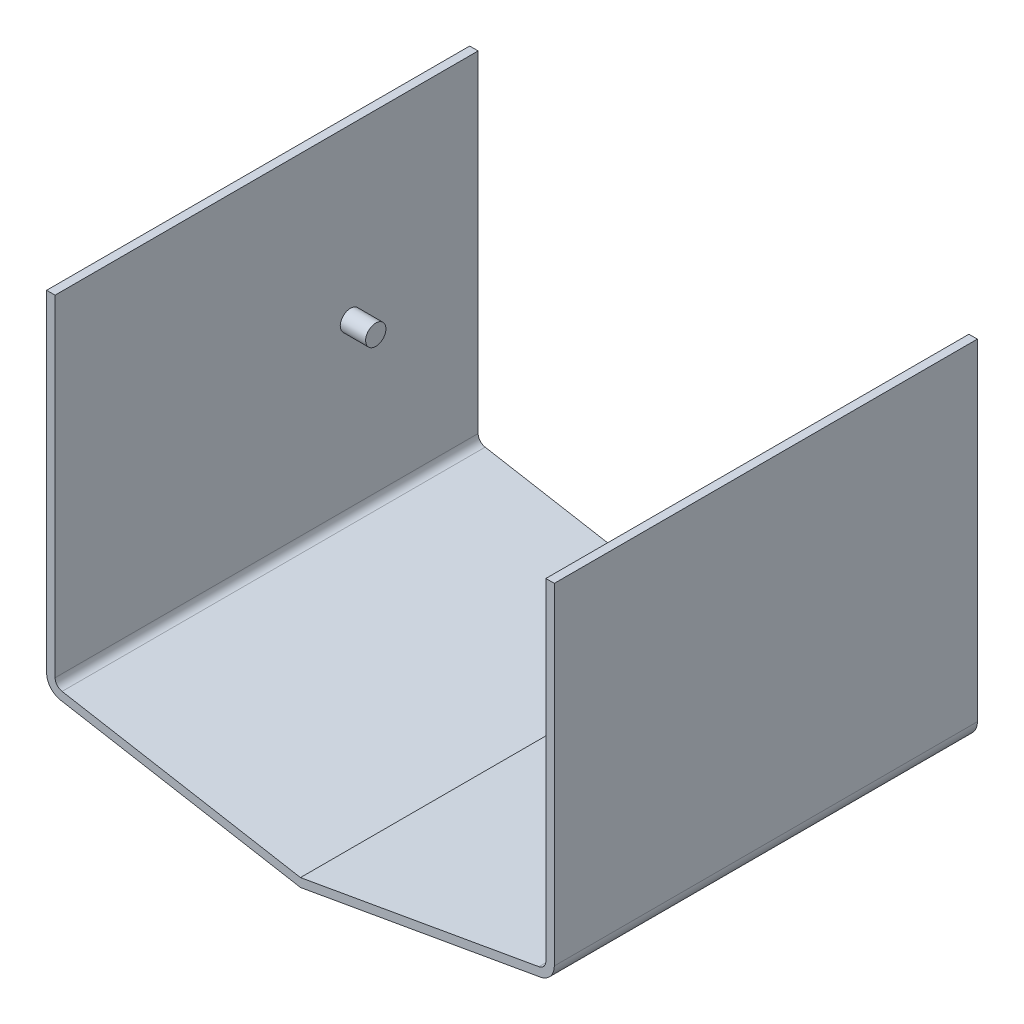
ISO-10303-21;
HEADER;
FILE_DESCRIPTION(('STEP AP214'),'2;1');
FILE_NAME('part.step','',(''),(''),'','','');
FILE_SCHEMA(('AUTOMOTIVE_DESIGN { 1 0 10303 214 1 1 1 1 }'));
ENDSEC;
DATA;
#1=APPLICATION_CONTEXT('core data for automotive mechanical design processes');
#2=APPLICATION_PROTOCOL_DEFINITION('international standard','automotive_design',2000,#1);
#3=PRODUCT_CONTEXT('',#1,'mechanical');
#4=PRODUCT('Part','Part','',(#3));
#5=PRODUCT_RELATED_PRODUCT_CATEGORY('part','',(#4));
#6=PRODUCT_DEFINITION_FORMATION('','',#4);
#7=PRODUCT_DEFINITION_CONTEXT('part definition',#1,'design');
#8=PRODUCT_DEFINITION('design','',#6,#7);
#9=PRODUCT_DEFINITION_SHAPE('','',#8);
#10=(LENGTH_UNIT() NAMED_UNIT(*) SI_UNIT(.MILLI.,.METRE.));
#11=(NAMED_UNIT(*) PLANE_ANGLE_UNIT() SI_UNIT($,.RADIAN.));
#12=(NAMED_UNIT(*) SI_UNIT($,.STERADIAN.) SOLID_ANGLE_UNIT());
#13=UNCERTAINTY_MEASURE_WITH_UNIT(LENGTH_MEASURE(1.E-05),#10,'distance_accuracy_value','');
#14=(GEOMETRIC_REPRESENTATION_CONTEXT(3) GLOBAL_UNCERTAINTY_ASSIGNED_CONTEXT((#13)) GLOBAL_UNIT_ASSIGNED_CONTEXT((#10,
#11,#12)) REPRESENTATION_CONTEXT('',''));
#15=CARTESIAN_POINT('',(0.,0.,0.));
#16=DIRECTION('',(0.,0.,1.));
#17=DIRECTION('',(1.,0.,0.));
#18=AXIS2_PLACEMENT_3D('',#15,#16,#17);
#19=CARTESIAN_POINT('',(-290.,0.,500.));
#20=DIRECTION('',(-1.,0.,0.));
#21=DIRECTION('',(0.,-1.,0.));
#22=AXIS2_PLACEMENT_3D('',#19,#20,#21);
#23=PLANE('',#22);
#24=DIRECTION('',(0.,1.,0.));
#25=VECTOR('',#24,1.);
#26=CARTESIAN_POINT('',(-290.,0.,0.));
#27=LINE('',#26,#25);
#28=CARTESIAN_POINT('',(-290.,-391.609003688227,0.));
#29=VERTEX_POINT('',#28);
#30=CARTESIAN_POINT('',(-290.,0.,0.));
#31=VERTEX_POINT('',#30);
#32=EDGE_CURVE('E178',#29,#31,#27,.T.);
#33=ORIENTED_EDGE('',*,*,#32,.T.);
#34=DIRECTION('',(0.,0.,-1.));
#35=VECTOR('',#34,1.);
#36=CARTESIAN_POINT('',(-290.,0.,500.));
#37=LINE('',#36,#35);
#38=CARTESIAN_POINT('',(-290.,0.,500.));
#39=VERTEX_POINT('',#38);
#40=EDGE_CURVE('E149',#39,#31,#37,.T.);
#41=ORIENTED_EDGE('',*,*,#40,.F.);
#42=DIRECTION('',(0.,1.,0.));
#43=VECTOR('',#42,1.);
#44=CARTESIAN_POINT('',(-290.,0.,500.));
#45=LINE('',#44,#43);
#46=CARTESIAN_POINT('',(-290.,-391.609003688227,500.));
#47=VERTEX_POINT('',#46);
#48=EDGE_CURVE('E44',#47,#39,#45,.T.);
#49=ORIENTED_EDGE('',*,*,#48,.F.);
#50=DIRECTION('',(0.,0.,-1.));
#51=VECTOR('',#50,1.);
#52=CARTESIAN_POINT('',(-290.,-391.609003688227,500.));
#53=LINE('',#52,#51);
#54=EDGE_CURVE('E206',#47,#29,#53,.T.);
#55=ORIENTED_EDGE('',*,*,#54,.T.);
#56=EDGE_LOOP('',(#33,#41,#49,#55));
#57=FACE_BOUND('',#56,.T.);
#58=CARTESIAN_POINT('',(-290.,-200.,151.));
#59=DIRECTION('',(-1.,0.,0.));
#60=DIRECTION('',(0.,-1.,0.));
#61=AXIS2_PLACEMENT_3D('',#58,#59,#60);
#62=CIRCLE('',#61,12.);
#63=CARTESIAN_POINT('',(-290.,-212.,151.));
#64=VERTEX_POINT('',#63);
#65=EDGE_CURVE('E11',#64,#64,#62,.F.);
#66=ORIENTED_EDGE('',*,*,#65,.F.);
#67=EDGE_LOOP('',(#66));
#68=FACE_BOUND('',#67,.T.);
#69=ADVANCED_FACE('F29',(#57,#68),#23,.F.);
#70=CARTESIAN_POINT('',(-290.,0.,500.));
#71=DIRECTION('',(0.,-1.,0.));
#72=DIRECTION('',(0.,0.,-1.));
#73=AXIS2_PLACEMENT_3D('',#70,#71,#72);
#74=PLANE('',#73);
#75=DIRECTION('',(-1.,0.,0.));
#76=VECTOR('',#75,1.);
#77=CARTESIAN_POINT('',(-290.,0.,0.));
#78=LINE('',#77,#76);
#79=CARTESIAN_POINT('',(-300.,0.,0.));
#80=VERTEX_POINT('',#79);
#81=EDGE_CURVE('E135',#31,#80,#78,.T.);
#82=ORIENTED_EDGE('',*,*,#81,.T.);
#83=DIRECTION('',(0.,0.,-1.));
#84=VECTOR('',#83,1.);
#85=CARTESIAN_POINT('',(-300.,0.,500.));
#86=LINE('',#85,#84);
#87=CARTESIAN_POINT('',(-300.,0.,500.));
#88=VERTEX_POINT('',#87);
#89=EDGE_CURVE('E37',#88,#80,#86,.T.);
#90=ORIENTED_EDGE('',*,*,#89,.F.);
#91=DIRECTION('',(-1.,0.,0.));
#92=VECTOR('',#91,1.);
#93=CARTESIAN_POINT('',(-290.,0.,500.));
#94=LINE('',#93,#92);
#95=EDGE_CURVE('E180',#39,#88,#94,.T.);
#96=ORIENTED_EDGE('',*,*,#95,.F.);
#97=ORIENTED_EDGE('',*,*,#40,.T.);
#98=EDGE_LOOP('',(#82,#90,#96,#97));
#99=FACE_BOUND('',#98,.T.);
#100=ADVANCED_FACE('F31',(#99),#74,.F.);
#101=CARTESIAN_POINT('',(-300.,0.,500.));
#102=DIRECTION('',(1.,0.,0.));
#103=DIRECTION('',(0.,1.,0.));
#104=AXIS2_PLACEMENT_3D('',#101,#102,#103);
#105=PLANE('',#104);
#106=DIRECTION('',(0.,-1.,0.));
#107=VECTOR('',#106,1.);
#108=CARTESIAN_POINT('',(-300.,0.,0.));
#109=LINE('',#108,#107);
#110=CARTESIAN_POINT('',(-300.,-391.609003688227,0.));
#111=VERTEX_POINT('',#110);
#112=EDGE_CURVE('E130',#80,#111,#109,.T.);
#113=ORIENTED_EDGE('',*,*,#112,.T.);
#114=DIRECTION('',(0.,0.,-1.));
#115=VECTOR('',#114,1.);
#116=CARTESIAN_POINT('',(-300.,-391.609003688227,500.));
#117=LINE('',#116,#115);
#118=CARTESIAN_POINT('',(-300.,-391.609003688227,500.));
#119=VERTEX_POINT('',#118);
#120=EDGE_CURVE('E147',#119,#111,#117,.T.);
#121=ORIENTED_EDGE('',*,*,#120,.F.);
#122=DIRECTION('',(0.,-1.,0.));
#123=VECTOR('',#122,1.);
#124=CARTESIAN_POINT('',(-300.,0.,500.));
#125=LINE('',#124,#123);
#126=EDGE_CURVE('E144',#88,#119,#125,.T.);
#127=ORIENTED_EDGE('',*,*,#126,.F.);
#128=ORIENTED_EDGE('',*,*,#89,.T.);
#129=EDGE_LOOP('',(#113,#121,#127,#128));
#130=FACE_BOUND('',#129,.T.);
#131=ADVANCED_FACE('F143',(#130),#105,.F.);
#132=CARTESIAN_POINT('',(-280.,-391.609003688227,500.));
#133=DIRECTION('',(0.,0.,-1.));
#134=DIRECTION('',(-1.,0.,0.));
#135=AXIS2_PLACEMENT_3D('',#132,#133,#134);
#136=CYLINDRICAL_SURFACE('',#135,20.);
#137=CARTESIAN_POINT('',(-280.,-391.609003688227,0.));
#138=DIRECTION('',(0.,0.,1.));
#139=DIRECTION('',(1.,0.,0.));
#140=AXIS2_PLACEMENT_3D('',#137,#138,#139);
#141=CIRCLE('',#140,20.);
#142=CARTESIAN_POINT('',(-283.472963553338,-411.305158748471,0.));
#143=VERTEX_POINT('',#142);
#144=EDGE_CURVE('E137',#111,#143,#141,.T.);
#145=ORIENTED_EDGE('',*,*,#144,.T.);
#146=DIRECTION('',(0.,0.,-1.));
#147=VECTOR('',#146,1.);
#148=CARTESIAN_POINT('',(-283.472963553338,-411.305158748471,500.));
#149=LINE('',#148,#147);
#150=CARTESIAN_POINT('',(-283.472963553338,-411.305158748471,500.));
#151=VERTEX_POINT('',#150);
#152=EDGE_CURVE('E236',#151,#143,#149,.T.);
#153=ORIENTED_EDGE('',*,*,#152,.F.);
#154=CARTESIAN_POINT('',(-280.,-391.609003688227,500.));
#155=DIRECTION('',(0.,0.,1.));
#156=DIRECTION('',(1.,0.,0.));
#157=AXIS2_PLACEMENT_3D('',#154,#155,#156);
#158=CIRCLE('',#157,20.);
#159=EDGE_CURVE('E183',#119,#151,#158,.T.);
#160=ORIENTED_EDGE('',*,*,#159,.F.);
#161=ORIENTED_EDGE('',*,*,#120,.T.);
#162=EDGE_LOOP('',(#145,#153,#160,#161));
#163=FACE_BOUND('',#162,.T.);
#164=ADVANCED_FACE('F241',(#163),#136,.T.);
#165=CARTESIAN_POINT('',(0.,-461.289090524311,500.));
#166=DIRECTION('',(0.173648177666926,0.984807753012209,0.));
#167=DIRECTION('',(-0.984807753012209,0.173648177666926,0.));
#168=AXIS2_PLACEMENT_3D('',#165,#166,#167);
#169=PLANE('',#168);
#170=DIRECTION('',(0.984807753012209,-0.173648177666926,0.));
#171=VECTOR('',#170,1.);
#172=CARTESIAN_POINT('',(0.,-461.289090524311,0.));
#173=LINE('',#172,#171);
#174=CARTESIAN_POINT('',(0.,-461.289090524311,0.));
#175=VERTEX_POINT('',#174);
#176=EDGE_CURVE('E158',#143,#175,#173,.T.);
#177=ORIENTED_EDGE('',*,*,#176,.T.);
#178=DIRECTION('',(0.,0.,-1.));
#179=VECTOR('',#178,1.);
#180=CARTESIAN_POINT('',(0.,-461.289090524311,500.));
#181=LINE('',#180,#179);
#182=CARTESIAN_POINT('',(0.,-461.289090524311,500.));
#183=VERTEX_POINT('',#182);
#184=EDGE_CURVE('E233',#183,#175,#181,.T.);
#185=ORIENTED_EDGE('',*,*,#184,.F.);
#186=DIRECTION('',(0.984807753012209,-0.173648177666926,0.));
#187=VECTOR('',#186,1.);
#188=CARTESIAN_POINT('',(0.,-461.289090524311,500.));
#189=LINE('',#188,#187);
#190=EDGE_CURVE('E185',#151,#183,#189,.T.);
#191=ORIENTED_EDGE('',*,*,#190,.F.);
#192=ORIENTED_EDGE('',*,*,#152,.T.);
#193=EDGE_LOOP('',(#177,#185,#191,#192));
#194=FACE_BOUND('',#193,.T.);
#195=ADVANCED_FACE('F249',(#194),#169,.F.);
#196=CARTESIAN_POINT('',(283.472963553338,-411.305158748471,500.));
#197=DIRECTION('',(-0.173648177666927,0.984807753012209,0.));
#198=DIRECTION('',(-0.984807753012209,-0.173648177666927,0.));
#199=AXIS2_PLACEMENT_3D('',#196,#197,#198);
#200=PLANE('',#199);
#201=DIRECTION('',(0.984807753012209,0.173648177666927,0.));
#202=VECTOR('',#201,1.);
#203=CARTESIAN_POINT('',(283.472963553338,-411.305158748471,0.));
#204=LINE('',#203,#202);
#205=CARTESIAN_POINT('',(283.472963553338,-411.305158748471,0.));
#206=VERTEX_POINT('',#205);
#207=EDGE_CURVE('E160',#175,#206,#204,.T.);
#208=ORIENTED_EDGE('',*,*,#207,.T.);
#209=DIRECTION('',(0.,0.,-1.));
#210=VECTOR('',#209,1.);
#211=CARTESIAN_POINT('',(283.472963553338,-411.305158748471,500.));
#212=LINE('',#211,#210);
#213=CARTESIAN_POINT('',(283.472963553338,-411.305158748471,500.));
#214=VERTEX_POINT('',#213);
#215=EDGE_CURVE('E230',#214,#206,#212,.T.);
#216=ORIENTED_EDGE('',*,*,#215,.F.);
#217=DIRECTION('',(0.984807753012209,0.173648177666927,0.));
#218=VECTOR('',#217,1.);
#219=CARTESIAN_POINT('',(283.472963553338,-411.305158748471,500.));
#220=LINE('',#219,#218);
#221=EDGE_CURVE('E187',#183,#214,#220,.T.);
#222=ORIENTED_EDGE('',*,*,#221,.F.);
#223=ORIENTED_EDGE('',*,*,#184,.T.);
#224=EDGE_LOOP('',(#208,#216,#222,#223));
#225=FACE_BOUND('',#224,.T.);
#226=ADVANCED_FACE('F252',(#225),#200,.F.);
#227=CARTESIAN_POINT('',(280.,-391.609003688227,500.));
#228=DIRECTION('',(0.,0.,-1.));
#229=DIRECTION('',(-1.,0.,0.));
#230=AXIS2_PLACEMENT_3D('',#227,#228,#229);
#231=CYLINDRICAL_SURFACE('',#230,20.);
#232=CARTESIAN_POINT('',(280.,-391.609003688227,0.));
#233=DIRECTION('',(0.,0.,1.));
#234=DIRECTION('',(-1.,0.,0.));
#235=AXIS2_PLACEMENT_3D('',#232,#233,#234);
#236=CIRCLE('',#235,20.);
#237=CARTESIAN_POINT('',(300.,-391.609003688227,0.));
#238=VERTEX_POINT('',#237);
#239=EDGE_CURVE('E162',#206,#238,#236,.T.);
#240=ORIENTED_EDGE('',*,*,#239,.T.);
#241=DIRECTION('',(0.,0.,-1.));
#242=VECTOR('',#241,1.);
#243=CARTESIAN_POINT('',(300.,-391.609003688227,500.));
#244=LINE('',#243,#242);
#245=CARTESIAN_POINT('',(300.,-391.609003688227,500.));
#246=VERTEX_POINT('',#245);
#247=EDGE_CURVE('E227',#246,#238,#244,.T.);
#248=ORIENTED_EDGE('',*,*,#247,.F.);
#249=CARTESIAN_POINT('',(280.,-391.609003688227,500.));
#250=DIRECTION('',(0.,0.,1.));
#251=DIRECTION('',(-1.,0.,0.));
#252=AXIS2_PLACEMENT_3D('',#249,#250,#251);
#253=CIRCLE('',#252,20.);
#254=EDGE_CURVE('E189',#214,#246,#253,.T.);
#255=ORIENTED_EDGE('',*,*,#254,.F.);
#256=ORIENTED_EDGE('',*,*,#215,.T.);
#257=EDGE_LOOP('',(#240,#248,#255,#256));
#258=FACE_BOUND('',#257,.T.);
#259=ADVANCED_FACE('F257',(#258),#231,.T.);
#260=CARTESIAN_POINT('',(300.,3.33066907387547E-13,500.));
#261=DIRECTION('',(-1.,0.,0.));
#262=DIRECTION('',(0.,-1.,0.));
#263=AXIS2_PLACEMENT_3D('',#260,#261,#262);
#264=PLANE('',#263);
#265=DIRECTION('',(0.,1.,0.));
#266=VECTOR('',#265,1.);
#267=CARTESIAN_POINT('',(300.,3.33066907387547E-13,0.));
#268=LINE('',#267,#266);
#269=CARTESIAN_POINT('',(300.,3.33066907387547E-13,0.));
#270=VERTEX_POINT('',#269);
#271=EDGE_CURVE('E164',#238,#270,#268,.T.);
#272=ORIENTED_EDGE('',*,*,#271,.T.);
#273=DIRECTION('',(0.,0.,-1.));
#274=VECTOR('',#273,1.);
#275=CARTESIAN_POINT('',(300.,3.33066907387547E-13,500.));
#276=LINE('',#275,#274);
#277=CARTESIAN_POINT('',(300.,3.33066907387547E-13,500.));
#278=VERTEX_POINT('',#277);
#279=EDGE_CURVE('E224',#278,#270,#276,.T.);
#280=ORIENTED_EDGE('',*,*,#279,.F.);
#281=DIRECTION('',(0.,1.,0.));
#282=VECTOR('',#281,1.);
#283=CARTESIAN_POINT('',(300.,3.33066907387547E-13,500.));
#284=LINE('',#283,#282);
#285=EDGE_CURVE('E191',#246,#278,#284,.T.);
#286=ORIENTED_EDGE('',*,*,#285,.F.);
#287=ORIENTED_EDGE('',*,*,#247,.T.);
#288=EDGE_LOOP('',(#272,#280,#286,#287));
#289=FACE_BOUND('',#288,.T.);
#290=ADVANCED_FACE('F263',(#289),#264,.F.);
#291=CARTESIAN_POINT('',(290.,3.33066907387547E-13,500.));
#292=DIRECTION('',(0.,-1.,0.));
#293=DIRECTION('',(0.,0.,-1.));
#294=AXIS2_PLACEMENT_3D('',#291,#292,#293);
#295=PLANE('',#294);
#296=DIRECTION('',(-1.,0.,0.));
#297=VECTOR('',#296,1.);
#298=CARTESIAN_POINT('',(290.,3.33066907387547E-13,0.));
#299=LINE('',#298,#297);
#300=CARTESIAN_POINT('',(290.,3.33066907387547E-13,0.));
#301=VERTEX_POINT('',#300);
#302=EDGE_CURVE('E166',#270,#301,#299,.T.);
#303=ORIENTED_EDGE('',*,*,#302,.T.);
#304=DIRECTION('',(0.,0.,-1.));
#305=VECTOR('',#304,1.);
#306=CARTESIAN_POINT('',(290.,3.33066907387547E-13,500.));
#307=LINE('',#306,#305);
#308=CARTESIAN_POINT('',(290.,3.33066907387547E-13,500.));
#309=VERTEX_POINT('',#308);
#310=EDGE_CURVE('E221',#309,#301,#307,.T.);
#311=ORIENTED_EDGE('',*,*,#310,.F.);
#312=DIRECTION('',(-1.,0.,0.));
#313=VECTOR('',#312,1.);
#314=CARTESIAN_POINT('',(290.,3.33066907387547E-13,500.));
#315=LINE('',#314,#313);
#316=EDGE_CURVE('E193',#278,#309,#315,.T.);
#317=ORIENTED_EDGE('',*,*,#316,.F.);
#318=ORIENTED_EDGE('',*,*,#279,.T.);
#319=EDGE_LOOP('',(#303,#311,#317,#318));
#320=FACE_BOUND('',#319,.T.);
#321=ADVANCED_FACE('F267',(#320),#295,.F.);
#322=CARTESIAN_POINT('',(290.,-391.609003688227,500.));
#323=DIRECTION('',(1.,0.,0.));
#324=DIRECTION('',(0.,0.,-1.));
#325=AXIS2_PLACEMENT_3D('',#322,#323,#324);
#326=PLANE('',#325);
#327=CARTESIAN_POINT('',(290.,-200.,151.));
#328=DIRECTION('',(1.,0.,0.));
#329=DIRECTION('',(0.,1.,0.));
#330=AXIS2_PLACEMENT_3D('',#327,#328,#329);
#331=CIRCLE('',#330,12.);
#332=CARTESIAN_POINT('',(290.,-188.,151.));
#333=VERTEX_POINT('',#332);
#334=EDGE_CURVE('E386',#333,#333,#331,.T.);
#335=ORIENTED_EDGE('',*,*,#334,.T.);
#336=EDGE_LOOP('',(#335));
#337=FACE_BOUND('',#336,.T.);
#338=DIRECTION('',(0.,-1.,0.));
#339=VECTOR('',#338,1.);
#340=CARTESIAN_POINT('',(290.,-391.609003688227,0.));
#341=LINE('',#340,#339);
#342=CARTESIAN_POINT('',(290.,-391.609003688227,0.));
#343=VERTEX_POINT('',#342);
#344=EDGE_CURVE('E168',#301,#343,#341,.T.);
#345=ORIENTED_EDGE('',*,*,#344,.T.);
#346=DIRECTION('',(0.,0.,-1.));
#347=VECTOR('',#346,1.);
#348=CARTESIAN_POINT('',(290.,-391.609003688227,500.));
#349=LINE('',#348,#347);
#350=CARTESIAN_POINT('',(290.,-391.609003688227,500.));
#351=VERTEX_POINT('',#350);
#352=EDGE_CURVE('E218',#351,#343,#349,.T.);
#353=ORIENTED_EDGE('',*,*,#352,.F.);
#354=DIRECTION('',(0.,-1.,0.));
#355=VECTOR('',#354,1.);
#356=CARTESIAN_POINT('',(290.,-391.609003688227,500.));
#357=LINE('',#356,#355);
#358=EDGE_CURVE('E195',#309,#351,#357,.T.);
#359=ORIENTED_EDGE('',*,*,#358,.F.);
#360=ORIENTED_EDGE('',*,*,#310,.T.);
#361=EDGE_LOOP('',(#345,#353,#359,#360));
#362=FACE_BOUND('',#361,.T.);
#363=ADVANCED_FACE('F272',(#337,#362),#326,.F.);
#364=CARTESIAN_POINT('',(280.,-391.609003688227,500.));
#365=DIRECTION('',(0.,0.,-1.));
#366=DIRECTION('',(-1.,0.,0.));
#367=AXIS2_PLACEMENT_3D('',#364,#365,#366);
#368=CYLINDRICAL_SURFACE('',#367,9.99999999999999);
#369=CARTESIAN_POINT('',(280.,-391.609003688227,0.));
#370=DIRECTION('',(0.,0.,-1.));
#371=DIRECTION('',(1.,0.,0.));
#372=AXIS2_PLACEMENT_3D('',#369,#370,#371);
#373=CIRCLE('',#372,9.99999999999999);
#374=CARTESIAN_POINT('',(281.736481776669,-401.457081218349,0.));
#375=VERTEX_POINT('',#374);
#376=EDGE_CURVE('E170',#343,#375,#373,.T.);
#377=ORIENTED_EDGE('',*,*,#376,.T.);
#378=DIRECTION('',(0.,0.,-1.));
#379=VECTOR('',#378,1.);
#380=CARTESIAN_POINT('',(281.736481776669,-401.457081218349,500.));
#381=LINE('',#380,#379);
#382=CARTESIAN_POINT('',(281.736481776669,-401.457081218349,500.));
#383=VERTEX_POINT('',#382);
#384=EDGE_CURVE('E215',#383,#375,#381,.T.);
#385=ORIENTED_EDGE('',*,*,#384,.F.);
#386=CARTESIAN_POINT('',(280.,-391.609003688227,500.));
#387=DIRECTION('',(0.,0.,-1.));
#388=DIRECTION('',(1.,0.,0.));
#389=AXIS2_PLACEMENT_3D('',#386,#387,#388);
#390=CIRCLE('',#389,9.99999999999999);
#391=EDGE_CURVE('E197',#351,#383,#390,.T.);
#392=ORIENTED_EDGE('',*,*,#391,.F.);
#393=ORIENTED_EDGE('',*,*,#352,.T.);
#394=EDGE_LOOP('',(#377,#385,#392,#393));
#395=FACE_BOUND('',#394,.T.);
#396=ADVANCED_FACE('F278',(#395),#368,.F.);
#397=CARTESIAN_POINT('',(0.,-451.134824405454,500.));
#398=DIRECTION('',(0.173648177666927,-0.984807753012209,0.));
#399=DIRECTION('',(0.984807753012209,0.173648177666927,0.));
#400=AXIS2_PLACEMENT_3D('',#397,#398,#399);
#401=PLANE('',#400);
#402=DIRECTION('',(-0.984807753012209,-0.173648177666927,0.));
#403=VECTOR('',#402,1.);
#404=CARTESIAN_POINT('',(0.,-451.134824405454,0.));
#405=LINE('',#404,#403);
#406=CARTESIAN_POINT('',(0.,-451.134824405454,0.));
#407=VERTEX_POINT('',#406);
#408=EDGE_CURVE('E172',#375,#407,#405,.T.);
#409=ORIENTED_EDGE('',*,*,#408,.T.);
#410=DIRECTION('',(0.,0.,-1.));
#411=VECTOR('',#410,1.);
#412=CARTESIAN_POINT('',(0.,-451.134824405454,500.));
#413=LINE('',#412,#411);
#414=CARTESIAN_POINT('',(0.,-451.134824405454,500.));
#415=VERTEX_POINT('',#414);
#416=EDGE_CURVE('E212',#415,#407,#413,.T.);
#417=ORIENTED_EDGE('',*,*,#416,.F.);
#418=DIRECTION('',(-0.984807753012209,-0.173648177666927,0.));
#419=VECTOR('',#418,1.);
#420=CARTESIAN_POINT('',(0.,-451.134824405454,500.));
#421=LINE('',#420,#419);
#422=EDGE_CURVE('E199',#383,#415,#421,.T.);
#423=ORIENTED_EDGE('',*,*,#422,.F.);
#424=ORIENTED_EDGE('',*,*,#384,.T.);
#425=EDGE_LOOP('',(#409,#417,#423,#424));
#426=FACE_BOUND('',#425,.T.);
#427=ADVANCED_FACE('F282',(#426),#401,.F.);
#428=CARTESIAN_POINT('',(-281.736481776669,-401.457081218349,500.));
#429=DIRECTION('',(-0.173648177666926,-0.984807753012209,0.));
#430=DIRECTION('',(0.984807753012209,-0.173648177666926,0.));
#431=AXIS2_PLACEMENT_3D('',#428,#429,#430);
#432=PLANE('',#431);
#433=DIRECTION('',(-0.984807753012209,0.173648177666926,0.));
#434=VECTOR('',#433,1.);
#435=CARTESIAN_POINT('',(-281.736481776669,-401.457081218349,0.));
#436=LINE('',#435,#434);
#437=CARTESIAN_POINT('',(-281.736481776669,-401.457081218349,0.));
#438=VERTEX_POINT('',#437);
#439=EDGE_CURVE('E174',#407,#438,#436,.T.);
#440=ORIENTED_EDGE('',*,*,#439,.T.);
#441=DIRECTION('',(0.,0.,-1.));
#442=VECTOR('',#441,1.);
#443=CARTESIAN_POINT('',(-281.736481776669,-401.457081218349,500.));
#444=LINE('',#443,#442);
#445=CARTESIAN_POINT('',(-281.736481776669,-401.457081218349,500.));
#446=VERTEX_POINT('',#445);
#447=EDGE_CURVE('E209',#446,#438,#444,.T.);
#448=ORIENTED_EDGE('',*,*,#447,.F.);
#449=DIRECTION('',(-0.984807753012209,0.173648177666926,0.));
#450=VECTOR('',#449,1.);
#451=CARTESIAN_POINT('',(-281.736481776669,-401.457081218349,500.));
#452=LINE('',#451,#450);
#453=EDGE_CURVE('E201',#415,#446,#452,.T.);
#454=ORIENTED_EDGE('',*,*,#453,.F.);
#455=ORIENTED_EDGE('',*,*,#416,.T.);
#456=EDGE_LOOP('',(#440,#448,#454,#455));
#457=FACE_BOUND('',#456,.T.);
#458=ADVANCED_FACE('F287',(#457),#432,.F.);
#459=CARTESIAN_POINT('',(-280.,-391.609003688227,500.));
#460=DIRECTION('',(0.,0.,-1.));
#461=DIRECTION('',(-1.,0.,0.));
#462=AXIS2_PLACEMENT_3D('',#459,#460,#461);
#463=CYLINDRICAL_SURFACE('',#462,9.99999999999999);
#464=CARTESIAN_POINT('',(-280.,-391.609003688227,0.));
#465=DIRECTION('',(0.,0.,-1.));
#466=DIRECTION('',(1.,0.,0.));
#467=AXIS2_PLACEMENT_3D('',#464,#465,#466);
#468=CIRCLE('',#467,9.99999999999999);
#469=EDGE_CURVE('E176',#438,#29,#468,.T.);
#470=ORIENTED_EDGE('',*,*,#469,.T.);
#471=ORIENTED_EDGE('',*,*,#54,.F.);
#472=CARTESIAN_POINT('',(-280.,-391.609003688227,500.));
#473=DIRECTION('',(0.,0.,-1.));
#474=DIRECTION('',(1.,0.,0.));
#475=AXIS2_PLACEMENT_3D('',#472,#473,#474);
#476=CIRCLE('',#475,9.99999999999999);
#477=EDGE_CURVE('E49',#446,#47,#476,.T.);
#478=ORIENTED_EDGE('',*,*,#477,.F.);
#479=ORIENTED_EDGE('',*,*,#447,.T.);
#480=EDGE_LOOP('',(#470,#471,#478,#479));
#481=FACE_BOUND('',#480,.T.);
#482=ADVANCED_FACE('F290',(#481),#463,.F.);
#483=CARTESIAN_POINT('',(-280.,-391.609003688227,500.));
#484=DIRECTION('',(0.,0.,1.));
#485=DIRECTION('',(1.,0.,0.));
#486=AXIS2_PLACEMENT_3D('',#483,#484,#485);
#487=PLANE('',#486);
#488=ORIENTED_EDGE('',*,*,#95,.T.);
#489=ORIENTED_EDGE('',*,*,#126,.T.);
#490=ORIENTED_EDGE('',*,*,#159,.T.);
#491=ORIENTED_EDGE('',*,*,#190,.T.);
#492=ORIENTED_EDGE('',*,*,#221,.T.);
#493=ORIENTED_EDGE('',*,*,#254,.T.);
#494=ORIENTED_EDGE('',*,*,#285,.T.);
#495=ORIENTED_EDGE('',*,*,#316,.T.);
#496=ORIENTED_EDGE('',*,*,#358,.T.);
#497=ORIENTED_EDGE('',*,*,#391,.T.);
#498=ORIENTED_EDGE('',*,*,#422,.T.);
#499=ORIENTED_EDGE('',*,*,#453,.T.);
#500=ORIENTED_EDGE('',*,*,#477,.T.);
#501=ORIENTED_EDGE('',*,*,#48,.T.);
#502=EDGE_LOOP('',(#488,#489,#490,#491,#492,#493,#494,#495,#496,#497,#498,#499,#500,#501));
#503=FACE_BOUND('',#502,.T.);
#504=ADVANCED_FACE('F244',(#503),#487,.T.);
#505=CARTESIAN_POINT('',(-280.,-391.609003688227,0.));
#506=DIRECTION('',(0.,0.,1.));
#507=DIRECTION('',(1.,0.,0.));
#508=AXIS2_PLACEMENT_3D('',#505,#506,#507);
#509=PLANE('',#508);
#510=ORIENTED_EDGE('',*,*,#81,.F.);
#511=ORIENTED_EDGE('',*,*,#32,.F.);
#512=ORIENTED_EDGE('',*,*,#469,.F.);
#513=ORIENTED_EDGE('',*,*,#439,.F.);
#514=ORIENTED_EDGE('',*,*,#408,.F.);
#515=ORIENTED_EDGE('',*,*,#376,.F.);
#516=ORIENTED_EDGE('',*,*,#344,.F.);
#517=ORIENTED_EDGE('',*,*,#302,.F.);
#518=ORIENTED_EDGE('',*,*,#271,.F.);
#519=ORIENTED_EDGE('',*,*,#239,.F.);
#520=ORIENTED_EDGE('',*,*,#207,.F.);
#521=ORIENTED_EDGE('',*,*,#176,.F.);
#522=ORIENTED_EDGE('',*,*,#144,.F.);
#523=ORIENTED_EDGE('',*,*,#112,.F.);
#524=EDGE_LOOP('',(#510,#511,#512,#513,#514,#515,#516,#517,#518,#519,#520,#521,#522,#523));
#525=FACE_BOUND('',#524,.T.);
#526=ADVANCED_FACE('F132',(#525),#509,.F.);
#527=CARTESIAN_POINT('',(-260.,-200.,151.));
#528=DIRECTION('',(-1.,0.,0.));
#529=DIRECTION('',(0.,-1.,0.));
#530=AXIS2_PLACEMENT_3D('',#527,#528,#529);
#531=CYLINDRICAL_SURFACE('',#530,12.);
#532=CARTESIAN_POINT('',(-260.,-200.,151.));
#533=DIRECTION('',(1.,0.,0.));
#534=DIRECTION('',(0.,1.,0.));
#535=AXIS2_PLACEMENT_3D('',#532,#533,#534);
#536=CIRCLE('',#535,12.);
#537=CARTESIAN_POINT('',(-260.,-188.,151.));
#538=VERTEX_POINT('',#537);
#539=EDGE_CURVE('E150',#538,#538,#536,.T.);
#540=ORIENTED_EDGE('',*,*,#539,.F.);
#541=EDGE_LOOP('',(#540));
#542=FACE_BOUND('',#541,.T.);
#543=ORIENTED_EDGE('',*,*,#65,.T.);
#544=EDGE_LOOP('',(#543));
#545=FACE_BOUND('',#544,.T.);
#546=ADVANCED_FACE('F297',(#542,#545),#531,.T.);
#547=CARTESIAN_POINT('',(-260.,-200.,151.));
#548=DIRECTION('',(1.,0.,0.));
#549=DIRECTION('',(0.,1.,0.));
#550=AXIS2_PLACEMENT_3D('',#547,#548,#549);
#551=PLANE('',#550);
#552=ORIENTED_EDGE('',*,*,#539,.T.);
#553=EDGE_LOOP('',(#552));
#554=FACE_BOUND('',#553,.T.);
#555=ADVANCED_FACE('F299',(#554),#551,.T.);
#556=CARTESIAN_POINT('',(260.,-200.,151.));
#557=DIRECTION('',(1.,0.,0.));
#558=DIRECTION('',(0.,1.,0.));
#559=AXIS2_PLACEMENT_3D('',#556,#557,#558);
#560=CYLINDRICAL_SURFACE('',#559,12.);
#561=CARTESIAN_POINT('',(260.,-200.,151.));
#562=DIRECTION('',(1.,0.,0.));
#563=DIRECTION('',(0.,1.,0.));
#564=AXIS2_PLACEMENT_3D('',#561,#562,#563);
#565=CIRCLE('',#564,12.);
#566=CARTESIAN_POINT('',(260.,-188.,151.));
#567=VERTEX_POINT('',#566);
#568=EDGE_CURVE('E153',#567,#567,#565,.T.);
#569=ORIENTED_EDGE('',*,*,#568,.T.);
#570=EDGE_LOOP('',(#569));
#571=FACE_BOUND('',#570,.T.);
#572=ORIENTED_EDGE('',*,*,#334,.F.);
#573=EDGE_LOOP('',(#572));
#574=FACE_BOUND('',#573,.T.);
#575=ADVANCED_FACE('F306',(#571,#574),#560,.T.);
#576=CARTESIAN_POINT('',(260.,-200.,151.));
#577=DIRECTION('',(-1.,0.,0.));
#578=DIRECTION('',(0.,1.,0.));
#579=AXIS2_PLACEMENT_3D('',#576,#577,#578);
#580=PLANE('',#579);
#581=ORIENTED_EDGE('',*,*,#568,.F.);
#582=EDGE_LOOP('',(#581));
#583=FACE_BOUND('',#582,.T.);
#584=ADVANCED_FACE('F371',(#583),#580,.T.);
#585=CLOSED_SHELL('',(#69,#100,#131,#164,#195,#226,#259,#290,#321,#363,#396,#427,#458,#482,#504,
#526,#546,#555,#575,#584));
#586=MANIFOLD_SOLID_BREP('B2',#585);
#587=ADVANCED_BREP_SHAPE_REPRESENTATION('',(#18,#586),#14);
#588=SHAPE_DEFINITION_REPRESENTATION(#9,#587);
ENDSEC;
END-ISO-10303-21;
